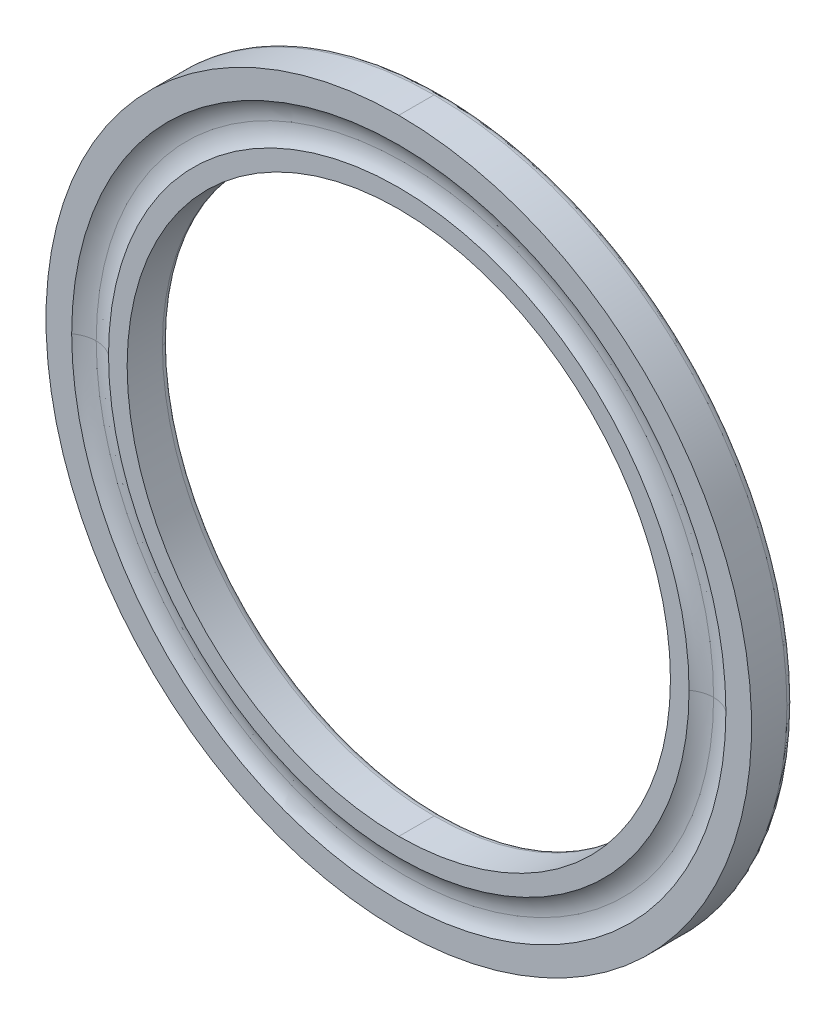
ISO-10303-21;
HEADER;
FILE_DESCRIPTION(('STEP AP214'),'2;1');
FILE_NAME('part.step','',(''),(''),'','','');
FILE_SCHEMA(('AUTOMOTIVE_DESIGN { 1 0 10303 214 1 1 1 1 }'));
ENDSEC;
DATA;
#1=APPLICATION_CONTEXT('core data for automotive mechanical design processes');
#2=APPLICATION_PROTOCOL_DEFINITION('international standard','automotive_design',2000,#1);
#3=PRODUCT_CONTEXT('',#1,'mechanical');
#4=PRODUCT('Part','Part','',(#3));
#5=PRODUCT_RELATED_PRODUCT_CATEGORY('part','',(#4));
#6=PRODUCT_DEFINITION_FORMATION('','',#4);
#7=PRODUCT_DEFINITION_CONTEXT('part definition',#1,'design');
#8=PRODUCT_DEFINITION('design','',#6,#7);
#9=PRODUCT_DEFINITION_SHAPE('','',#8);
#10=(LENGTH_UNIT() NAMED_UNIT(*) SI_UNIT(.MILLI.,.METRE.));
#11=(NAMED_UNIT(*) PLANE_ANGLE_UNIT() SI_UNIT($,.RADIAN.));
#12=(NAMED_UNIT(*) SI_UNIT($,.STERADIAN.) SOLID_ANGLE_UNIT());
#13=UNCERTAINTY_MEASURE_WITH_UNIT(LENGTH_MEASURE(1.E-05),#10,'distance_accuracy_value','');
#14=(GEOMETRIC_REPRESENTATION_CONTEXT(3) GLOBAL_UNCERTAINTY_ASSIGNED_CONTEXT((#13)) GLOBAL_UNIT_ASSIGNED_CONTEXT((#10,
#11,#12)) REPRESENTATION_CONTEXT('',''));
#15=CARTESIAN_POINT('',(0.,0.,0.));
#16=DIRECTION('',(0.,0.,1.));
#17=DIRECTION('',(1.,0.,0.));
#18=AXIS2_PLACEMENT_3D('',#15,#16,#17);
#19=CARTESIAN_POINT('',(0.,0.,-18.));
#20=DIRECTION('',(0.,0.,1.));
#21=DIRECTION('',(1.,0.,0.));
#22=AXIS2_PLACEMENT_3D('',#19,#20,#21);
#23=TOROIDAL_SURFACE('',#22,39.5,0.999999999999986);
#24=CARTESIAN_POINT('',(39.5,0.,-18.));
#25=DIRECTION('',(0.,-1.,0.));
#26=DIRECTION('',(-0.707106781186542,0.,-0.707106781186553));
#27=AXIS2_PLACEMENT_3D('',#24,#25,#26);
#28=CIRCLE('',#27,0.999999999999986);
#29=CARTESIAN_POINT('',(38.7928932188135,0.,-18.7071067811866));
#30=VERTEX_POINT('',#29);
#31=CARTESIAN_POINT('',(39.5,0.,-19.));
#32=VERTEX_POINT('',#31);
#33=EDGE_CURVE('E24',#30,#32,#28,.T.);
#34=ORIENTED_EDGE('',*,*,#33,.F.);
#35=CARTESIAN_POINT('',(0.,0.,-18.7071067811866));
#36=DIRECTION('',(0.,0.,1.));
#37=DIRECTION('',(1.,0.,0.));
#38=AXIS2_PLACEMENT_3D('',#35,#36,#37);
#39=CIRCLE('',#38,38.7928932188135);
#40=CARTESIAN_POINT('',(-38.7928932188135,0.,-18.7071067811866));
#41=VERTEX_POINT('',#40);
#42=EDGE_CURVE('E19',#30,#41,#39,.T.);
#43=ORIENTED_EDGE('',*,*,#42,.T.);
#44=CARTESIAN_POINT('',(-39.5,0.,-18.));
#45=DIRECTION('',(0.,1.,0.));
#46=DIRECTION('',(0.707106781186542,0.,-0.707106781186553));
#47=AXIS2_PLACEMENT_3D('',#44,#45,#46);
#48=CIRCLE('',#47,0.999999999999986);
#49=CARTESIAN_POINT('',(-39.5,0.,-19.));
#50=VERTEX_POINT('',#49);
#51=EDGE_CURVE('E10',#41,#50,#48,.T.);
#52=ORIENTED_EDGE('',*,*,#51,.T.);
#53=CARTESIAN_POINT('',(0.,0.,-19.));
#54=DIRECTION('',(0.,0.,1.));
#55=DIRECTION('',(0.,1.,0.));
#56=AXIS2_PLACEMENT_3D('',#53,#54,#55);
#57=CIRCLE('',#56,39.5);
#58=CARTESIAN_POINT('',(0.,39.5,-19.));
#59=VERTEX_POINT('',#58);
#60=EDGE_CURVE('E38',#59,#50,#57,.T.);
#61=ORIENTED_EDGE('',*,*,#60,.F.);
#62=CARTESIAN_POINT('',(0.,0.,-19.));
#63=DIRECTION('',(0.,0.,1.));
#64=DIRECTION('',(1.,0.,0.));
#65=AXIS2_PLACEMENT_3D('',#62,#63,#64);
#66=CIRCLE('',#65,39.5);
#67=EDGE_CURVE('E266',#32,#59,#66,.T.);
#68=ORIENTED_EDGE('',*,*,#67,.F.);
#69=EDGE_LOOP('',(#34,#43,#52,#61,#68));
#70=FACE_BOUND('',#69,.T.);
#71=ADVANCED_FACE('F16',(#70),#23,.T.);
#72=CARTESIAN_POINT('',(0.,0.,-18.));
#73=DIRECTION('',(0.,0.,1.));
#74=DIRECTION('',(1.,0.,0.));
#75=AXIS2_PLACEMENT_3D('',#72,#73,#74);
#76=TOROIDAL_SURFACE('',#75,39.5,0.999999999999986);
#77=CARTESIAN_POINT('',(0.,0.,-19.));
#78=DIRECTION('',(0.,0.,1.));
#79=DIRECTION('',(-1.,0.,0.));
#80=AXIS2_PLACEMENT_3D('',#77,#78,#79);
#81=CIRCLE('',#80,39.5);
#82=CARTESIAN_POINT('',(0.,-39.5,-19.));
#83=VERTEX_POINT('',#82);
#84=EDGE_CURVE('E170',#50,#83,#81,.T.);
#85=ORIENTED_EDGE('',*,*,#84,.F.);
#86=ORIENTED_EDGE('',*,*,#51,.F.);
#87=CARTESIAN_POINT('',(0.,0.,-18.7071067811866));
#88=DIRECTION('',(0.,0.,1.));
#89=DIRECTION('',(-1.,0.,0.));
#90=AXIS2_PLACEMENT_3D('',#87,#88,#89);
#91=CIRCLE('',#90,38.7928932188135);
#92=EDGE_CURVE('E246',#41,#30,#91,.T.);
#93=ORIENTED_EDGE('',*,*,#92,.T.);
#94=ORIENTED_EDGE('',*,*,#33,.T.);
#95=CARTESIAN_POINT('',(0.,0.,-19.));
#96=DIRECTION('',(0.,0.,1.));
#97=DIRECTION('',(0.,-1.,0.));
#98=AXIS2_PLACEMENT_3D('',#95,#96,#97);
#99=CIRCLE('',#98,39.5);
#100=EDGE_CURVE('E31',#83,#32,#99,.T.);
#101=ORIENTED_EDGE('',*,*,#100,.F.);
#102=EDGE_LOOP('',(#85,#86,#93,#94,#101));
#103=FACE_BOUND('',#102,.T.);
#104=ADVANCED_FACE('F257',(#103),#76,.T.);
#105=CARTESIAN_POINT('',(0.,0.,-18.));
#106=DIRECTION('',(0.,0.,1.));
#107=DIRECTION('',(1.,0.,0.));
#108=AXIS2_PLACEMENT_3D('',#105,#106,#107);
#109=TOROIDAL_SURFACE('',#108,39.5,0.999999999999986);
#110=CARTESIAN_POINT('',(0.,0.,-18.));
#111=DIRECTION('',(0.,0.,1.));
#112=DIRECTION('',(0.,-1.,0.));
#113=AXIS2_PLACEMENT_3D('',#110,#111,#112);
#114=CIRCLE('',#113,38.5);
#115=CARTESIAN_POINT('',(0.,-38.5,-18.));
#116=VERTEX_POINT('',#115);
#117=CARTESIAN_POINT('',(38.5,0.,-18.));
#118=VERTEX_POINT('',#117);
#119=EDGE_CURVE('E237',#116,#118,#114,.T.);
#120=ORIENTED_EDGE('',*,*,#119,.T.);
#121=CARTESIAN_POINT('',(39.5,0.,-18.));
#122=DIRECTION('',(0.,-1.,0.));
#123=DIRECTION('',(-1.,0.,0.));
#124=AXIS2_PLACEMENT_3D('',#121,#122,#123);
#125=CIRCLE('',#124,0.999999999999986);
#126=EDGE_CURVE('E241',#118,#30,#125,.T.);
#127=ORIENTED_EDGE('',*,*,#126,.T.);
#128=ORIENTED_EDGE('',*,*,#92,.F.);
#129=CARTESIAN_POINT('',(-39.5,0.,-18.));
#130=DIRECTION('',(0.,1.,0.));
#131=DIRECTION('',(1.,0.,0.));
#132=AXIS2_PLACEMENT_3D('',#129,#130,#131);
#133=CIRCLE('',#132,0.999999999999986);
#134=CARTESIAN_POINT('',(-38.5,0.,-18.));
#135=VERTEX_POINT('',#134);
#136=EDGE_CURVE('E247',#135,#41,#133,.T.);
#137=ORIENTED_EDGE('',*,*,#136,.F.);
#138=CARTESIAN_POINT('',(0.,0.,-18.));
#139=DIRECTION('',(0.,0.,1.));
#140=DIRECTION('',(-1.,0.,0.));
#141=AXIS2_PLACEMENT_3D('',#138,#139,#140);
#142=CIRCLE('',#141,38.5);
#143=EDGE_CURVE('E244',#135,#116,#142,.T.);
#144=ORIENTED_EDGE('',*,*,#143,.T.);
#145=EDGE_LOOP('',(#120,#127,#128,#137,#144));
#146=FACE_BOUND('',#145,.T.);
#147=ADVANCED_FACE('F261',(#146),#109,.T.);
#148=CARTESIAN_POINT('',(0.,0.,-15.5));
#149=DIRECTION('',(0.,0.,1.));
#150=DIRECTION('',(0.,1.,0.));
#151=AXIS2_PLACEMENT_3D('',#148,#149,#150);
#152=CYLINDRICAL_SURFACE('',#151,38.5);
#153=CARTESIAN_POINT('',(0.,0.,-18.));
#154=DIRECTION('',(0.,0.,1.));
#155=DIRECTION('',(0.,1.,0.));
#156=AXIS2_PLACEMENT_3D('',#153,#154,#155);
#157=CIRCLE('',#156,38.5);
#158=CARTESIAN_POINT('',(0.,38.5,-18.));
#159=VERTEX_POINT('',#158);
#160=EDGE_CURVE('E238',#159,#135,#157,.T.);
#161=ORIENTED_EDGE('',*,*,#160,.F.);
#162=DIRECTION('',(0.,0.,1.));
#163=VECTOR('',#162,1.);
#164=CARTESIAN_POINT('',(0.,38.5,-18.));
#165=LINE('',#164,#163);
#166=CARTESIAN_POINT('',(0.,38.5,-13.));
#167=VERTEX_POINT('',#166);
#168=EDGE_CURVE('E232',#159,#167,#165,.T.);
#169=ORIENTED_EDGE('',*,*,#168,.T.);
#170=CARTESIAN_POINT('',(0.,0.,-13.));
#171=DIRECTION('',(0.,0.,-1.));
#172=DIRECTION('',(0.,-1.,0.));
#173=AXIS2_PLACEMENT_3D('',#170,#171,#172);
#174=CIRCLE('',#173,38.5);
#175=CARTESIAN_POINT('',(0.,-38.5,-13.));
#176=VERTEX_POINT('',#175);
#177=EDGE_CURVE('E228',#176,#167,#174,.T.);
#178=ORIENTED_EDGE('',*,*,#177,.F.);
#179=DIRECTION('',(0.,0.,1.));
#180=VECTOR('',#179,1.);
#181=CARTESIAN_POINT('',(0.,-38.5,-18.));
#182=LINE('',#181,#180);
#183=EDGE_CURVE('E234',#116,#176,#182,.T.);
#184=ORIENTED_EDGE('',*,*,#183,.F.);
#185=ORIENTED_EDGE('',*,*,#143,.F.);
#186=EDGE_LOOP('',(#161,#169,#178,#184,#185));
#187=FACE_BOUND('',#186,.T.);
#188=ADVANCED_FACE('F288',(#187),#152,.F.);
#189=CARTESIAN_POINT('',(0.,0.,-18.));
#190=DIRECTION('',(0.,0.,1.));
#191=DIRECTION('',(1.,0.,0.));
#192=AXIS2_PLACEMENT_3D('',#189,#190,#191);
#193=TOROIDAL_SURFACE('',#192,39.5,0.999999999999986);
#194=ORIENTED_EDGE('',*,*,#136,.T.);
#195=ORIENTED_EDGE('',*,*,#42,.F.);
#196=ORIENTED_EDGE('',*,*,#126,.F.);
#197=CARTESIAN_POINT('',(0.,0.,-18.));
#198=DIRECTION('',(0.,0.,1.));
#199=DIRECTION('',(1.,0.,0.));
#200=AXIS2_PLACEMENT_3D('',#197,#198,#199);
#201=CIRCLE('',#200,38.5);
#202=EDGE_CURVE('E231',#118,#159,#201,.T.);
#203=ORIENTED_EDGE('',*,*,#202,.T.);
#204=ORIENTED_EDGE('',*,*,#160,.T.);
#205=EDGE_LOOP('',(#194,#195,#196,#203,#204));
#206=FACE_BOUND('',#205,.T.);
#207=ADVANCED_FACE('F265',(#206),#193,.T.);
#208=CARTESIAN_POINT('',(0.,0.,-15.5));
#209=DIRECTION('',(0.,0.,1.));
#210=DIRECTION('',(0.,1.,0.));
#211=AXIS2_PLACEMENT_3D('',#208,#209,#210);
#212=CYLINDRICAL_SURFACE('',#211,38.5);
#213=ORIENTED_EDGE('',*,*,#119,.F.);
#214=ORIENTED_EDGE('',*,*,#183,.T.);
#215=CARTESIAN_POINT('',(0.,0.,-13.));
#216=DIRECTION('',(0.,0.,-1.));
#217=DIRECTION('',(0.,1.,0.));
#218=AXIS2_PLACEMENT_3D('',#215,#216,#217);
#219=CIRCLE('',#218,38.5);
#220=EDGE_CURVE('E222',#167,#176,#219,.T.);
#221=ORIENTED_EDGE('',*,*,#220,.F.);
#222=ORIENTED_EDGE('',*,*,#168,.F.);
#223=ORIENTED_EDGE('',*,*,#202,.F.);
#224=EDGE_LOOP('',(#213,#214,#221,#222,#223));
#225=FACE_BOUND('',#224,.T.);
#226=ADVANCED_FACE('F296',(#225),#212,.F.);
#227=CARTESIAN_POINT('',(0.,0.,-9.50050000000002));
#228=DIRECTION('',(0.,0.,1.));
#229=DIRECTION('',(1.,0.,0.));
#230=AXIS2_PLACEMENT_3D('',#227,#228,#229);
#231=TOROIDAL_SURFACE('',#230,43.75,4.36549999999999);
#232=CARTESIAN_POINT('',(43.75,0.,-9.50050000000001));
#233=DIRECTION('',(0.,-1.,0.));
#234=DIRECTION('',(-0.597825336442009,0.,-0.801626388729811));
#235=AXIS2_PLACEMENT_3D('',#232,#233,#234);
#236=CIRCLE('',#235,4.36549999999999);
#237=CARTESIAN_POINT('',(41.1401934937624,0.,-13.));
#238=VERTEX_POINT('',#237);
#239=CARTESIAN_POINT('',(43.75,0.,-13.866));
#240=VERTEX_POINT('',#239);
#241=EDGE_CURVE('E210',#238,#240,#236,.T.);
#242=ORIENTED_EDGE('',*,*,#241,.T.);
#243=CARTESIAN_POINT('',(0.,0.,-13.866));
#244=DIRECTION('',(0.,0.,1.));
#245=DIRECTION('',(1.,0.,0.));
#246=AXIS2_PLACEMENT_3D('',#243,#244,#245);
#247=CIRCLE('',#246,43.75);
#248=CARTESIAN_POINT('',(-43.75,0.,-13.866));
#249=VERTEX_POINT('',#248);
#250=EDGE_CURVE('E200',#240,#249,#247,.T.);
#251=ORIENTED_EDGE('',*,*,#250,.T.);
#252=CARTESIAN_POINT('',(-43.75,0.,-9.50050000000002));
#253=DIRECTION('',(0.,1.,0.));
#254=DIRECTION('',(0.597825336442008,0.,-0.801626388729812));
#255=AXIS2_PLACEMENT_3D('',#252,#253,#254);
#256=CIRCLE('',#255,4.36549999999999);
#257=CARTESIAN_POINT('',(-41.1401934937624,0.,-13.));
#258=VERTEX_POINT('',#257);
#259=EDGE_CURVE('E212',#258,#249,#256,.T.);
#260=ORIENTED_EDGE('',*,*,#259,.F.);
#261=CARTESIAN_POINT('',(0.,0.,-13.));
#262=DIRECTION('',(0.,0.,1.));
#263=DIRECTION('',(0.,1.,0.));
#264=AXIS2_PLACEMENT_3D('',#261,#262,#263);
#265=CIRCLE('',#264,41.1401934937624);
#266=CARTESIAN_POINT('',(0.,41.1401934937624,-13.));
#267=VERTEX_POINT('',#266);
#268=EDGE_CURVE('E216',#267,#258,#265,.T.);
#269=ORIENTED_EDGE('',*,*,#268,.F.);
#270=CARTESIAN_POINT('',(0.,0.,-13.));
#271=DIRECTION('',(0.,0.,1.));
#272=DIRECTION('',(1.,0.,0.));
#273=AXIS2_PLACEMENT_3D('',#270,#271,#272);
#274=CIRCLE('',#273,41.1401934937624);
#275=EDGE_CURVE('E219',#238,#267,#274,.T.);
#276=ORIENTED_EDGE('',*,*,#275,.F.);
#277=EDGE_LOOP('',(#242,#251,#260,#269,#276));
#278=FACE_BOUND('',#277,.T.);
#279=ADVANCED_FACE('F299',(#278),#231,.F.);
#280=CARTESIAN_POINT('',(0.,39.8200967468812,-13.));
#281=DIRECTION('',(0.,0.,1.));
#282=DIRECTION('',(1.,0.,0.));
#283=AXIS2_PLACEMENT_3D('',#280,#281,#282);
#284=PLANE('',#283);
#285=ORIENTED_EDGE('',*,*,#177,.T.);
#286=ORIENTED_EDGE('',*,*,#220,.T.);
#287=EDGE_LOOP('',(#285,#286));
#288=FACE_BOUND('',#287,.T.);
#289=CARTESIAN_POINT('',(0.,0.,-13.));
#290=DIRECTION('',(0.,0.,1.));
#291=DIRECTION('',(-1.,0.,0.));
#292=AXIS2_PLACEMENT_3D('',#289,#290,#291);
#293=CIRCLE('',#292,41.1401934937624);
#294=CARTESIAN_POINT('',(0.,-41.1401934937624,-13.));
#295=VERTEX_POINT('',#294);
#296=EDGE_CURVE('E215',#258,#295,#293,.T.);
#297=ORIENTED_EDGE('',*,*,#296,.T.);
#298=CARTESIAN_POINT('',(0.,0.,-13.));
#299=DIRECTION('',(0.,0.,1.));
#300=DIRECTION('',(0.,-1.,0.));
#301=AXIS2_PLACEMENT_3D('',#298,#299,#300);
#302=CIRCLE('',#301,41.1401934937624);
#303=EDGE_CURVE('E207',#295,#238,#302,.T.);
#304=ORIENTED_EDGE('',*,*,#303,.T.);
#305=ORIENTED_EDGE('',*,*,#275,.T.);
#306=ORIENTED_EDGE('',*,*,#268,.T.);
#307=EDGE_LOOP('',(#297,#304,#305,#306));
#308=FACE_BOUND('',#307,.T.);
#309=ADVANCED_FACE('F303',(#288,#308),#284,.T.);
#310=CARTESIAN_POINT('',(0.,0.,-9.50050000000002));
#311=DIRECTION('',(0.,0.,1.));
#312=DIRECTION('',(1.,0.,0.));
#313=AXIS2_PLACEMENT_3D('',#310,#311,#312);
#314=TOROIDAL_SURFACE('',#313,43.75,4.36549999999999);
#315=ORIENTED_EDGE('',*,*,#296,.F.);
#316=ORIENTED_EDGE('',*,*,#259,.T.);
#317=CARTESIAN_POINT('',(0.,0.,-13.866));
#318=DIRECTION('',(0.,0.,1.));
#319=DIRECTION('',(-1.,0.,0.));
#320=AXIS2_PLACEMENT_3D('',#317,#318,#319);
#321=CIRCLE('',#320,43.75);
#322=EDGE_CURVE('E204',#249,#240,#321,.T.);
#323=ORIENTED_EDGE('',*,*,#322,.T.);
#324=ORIENTED_EDGE('',*,*,#241,.F.);
#325=ORIENTED_EDGE('',*,*,#303,.F.);
#326=EDGE_LOOP('',(#315,#316,#323,#324,#325));
#327=FACE_BOUND('',#326,.T.);
#328=ADVANCED_FACE('F307',(#327),#314,.F.);
#329=CARTESIAN_POINT('',(0.,0.,-9.50050000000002));
#330=DIRECTION('',(0.,0.,1.));
#331=DIRECTION('',(1.,0.,0.));
#332=AXIS2_PLACEMENT_3D('',#329,#330,#331);
#333=TOROIDAL_SURFACE('',#332,43.75,4.36549999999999);
#334=CARTESIAN_POINT('',(43.75,0.,-9.50050000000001));
#335=DIRECTION('',(0.,-1.,0.));
#336=DIRECTION('',(0.,0.,-1.));
#337=AXIS2_PLACEMENT_3D('',#334,#335,#336);
#338=CIRCLE('',#337,4.36549999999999);
#339=CARTESIAN_POINT('',(46.3598065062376,0.,-13.));
#340=VERTEX_POINT('',#339);
#341=EDGE_CURVE('E198',#240,#340,#338,.T.);
#342=ORIENTED_EDGE('',*,*,#341,.F.);
#343=ORIENTED_EDGE('',*,*,#322,.F.);
#344=CARTESIAN_POINT('',(-43.75,0.,-9.50050000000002));
#345=DIRECTION('',(0.,1.,0.));
#346=DIRECTION('',(0.,0.,-1.));
#347=AXIS2_PLACEMENT_3D('',#344,#345,#346);
#348=CIRCLE('',#347,4.36549999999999);
#349=CARTESIAN_POINT('',(-46.3598065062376,0.,-13.));
#350=VERTEX_POINT('',#349);
#351=EDGE_CURVE('E202',#249,#350,#348,.T.);
#352=ORIENTED_EDGE('',*,*,#351,.T.);
#353=CARTESIAN_POINT('',(0.,0.,-13.));
#354=DIRECTION('',(0.,0.,-1.));
#355=DIRECTION('',(1.,0.,0.));
#356=AXIS2_PLACEMENT_3D('',#353,#354,#355);
#357=CIRCLE('',#356,46.3598065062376);
#358=EDGE_CURVE('E193',#340,#350,#357,.T.);
#359=ORIENTED_EDGE('',*,*,#358,.F.);
#360=EDGE_LOOP('',(#342,#343,#352,#359));
#361=FACE_BOUND('',#360,.T.);
#362=ADVANCED_FACE('F311',(#361),#333,.F.);
#363=CARTESIAN_POINT('',(0.,0.,-9.50050000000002));
#364=DIRECTION('',(0.,0.,1.));
#365=DIRECTION('',(1.,0.,0.));
#366=AXIS2_PLACEMENT_3D('',#363,#364,#365);
#367=TOROIDAL_SURFACE('',#366,43.75,4.36549999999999);
#368=ORIENTED_EDGE('',*,*,#351,.F.);
#369=ORIENTED_EDGE('',*,*,#250,.F.);
#370=ORIENTED_EDGE('',*,*,#341,.T.);
#371=CARTESIAN_POINT('',(0.,0.,-13.));
#372=DIRECTION('',(0.,0.,-1.));
#373=DIRECTION('',(0.,1.,0.));
#374=AXIS2_PLACEMENT_3D('',#371,#372,#373);
#375=CIRCLE('',#374,46.3598065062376);
#376=CARTESIAN_POINT('',(0.,46.3598065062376,-13.));
#377=VERTEX_POINT('',#376);
#378=EDGE_CURVE('E185',#377,#340,#375,.T.);
#379=ORIENTED_EDGE('',*,*,#378,.F.);
#380=CARTESIAN_POINT('',(0.,0.,-13.));
#381=DIRECTION('',(0.,0.,-1.));
#382=DIRECTION('',(-1.,0.,0.));
#383=AXIS2_PLACEMENT_3D('',#380,#381,#382);
#384=CIRCLE('',#383,46.3598065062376);
#385=EDGE_CURVE('E190',#350,#377,#384,.T.);
#386=ORIENTED_EDGE('',*,*,#385,.F.);
#387=EDGE_LOOP('',(#368,#369,#370,#379,#386));
#388=FACE_BOUND('',#387,.T.);
#389=ADVANCED_FACE('F315',(#388),#367,.F.);
#390=CARTESIAN_POINT('',(0.,0.,-18.));
#391=DIRECTION('',(0.,0.,1.));
#392=DIRECTION('',(1.,0.,0.));
#393=AXIS2_PLACEMENT_3D('',#390,#391,#392);
#394=TOROIDAL_SURFACE('',#393,49.,0.999999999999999);
#395=CARTESIAN_POINT('',(49.,0.,-18.));
#396=DIRECTION('',(0.,-1.,0.));
#397=DIRECTION('',(0.707106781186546,0.,-0.707106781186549));
#398=AXIS2_PLACEMENT_3D('',#395,#396,#397);
#399=CIRCLE('',#398,0.999999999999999);
#400=CARTESIAN_POINT('',(49.7071067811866,0.,-18.7071067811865));
#401=VERTEX_POINT('',#400);
#402=CARTESIAN_POINT('',(50.,0.,-18.));
#403=VERTEX_POINT('',#402);
#404=EDGE_CURVE('E163',#401,#403,#399,.T.);
#405=ORIENTED_EDGE('',*,*,#404,.F.);
#406=CARTESIAN_POINT('',(0.,0.,-18.7071067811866));
#407=DIRECTION('',(0.,0.,1.));
#408=DIRECTION('',(1.,0.,0.));
#409=AXIS2_PLACEMENT_3D('',#406,#407,#408);
#410=CIRCLE('',#409,49.7071067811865);
#411=CARTESIAN_POINT('',(-49.7071067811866,0.,-18.7071067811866));
#412=VERTEX_POINT('',#411);
#413=EDGE_CURVE('E153',#401,#412,#410,.T.);
#414=ORIENTED_EDGE('',*,*,#413,.T.);
#415=CARTESIAN_POINT('',(-49.,0.,-18.));
#416=DIRECTION('',(0.,1.,0.));
#417=DIRECTION('',(-0.707106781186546,0.,-0.707106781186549));
#418=AXIS2_PLACEMENT_3D('',#415,#416,#417);
#419=CIRCLE('',#418,0.999999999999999);
#420=CARTESIAN_POINT('',(-50.,0.,-18.));
#421=VERTEX_POINT('',#420);
#422=EDGE_CURVE('E167',#412,#421,#419,.T.);
#423=ORIENTED_EDGE('',*,*,#422,.T.);
#424=CARTESIAN_POINT('',(0.,0.,-18.));
#425=DIRECTION('',(0.,0.,-1.));
#426=DIRECTION('',(-1.,0.,0.));
#427=AXIS2_PLACEMENT_3D('',#424,#425,#426);
#428=CIRCLE('',#427,50.);
#429=CARTESIAN_POINT('',(0.,50.,-18.));
#430=VERTEX_POINT('',#429);
#431=EDGE_CURVE('E196',#421,#430,#428,.T.);
#432=ORIENTED_EDGE('',*,*,#431,.T.);
#433=CARTESIAN_POINT('',(0.,0.,-18.));
#434=DIRECTION('',(0.,0.,-1.));
#435=DIRECTION('',(0.,1.,0.));
#436=AXIS2_PLACEMENT_3D('',#433,#434,#435);
#437=CIRCLE('',#436,50.);
#438=EDGE_CURVE('E179',#430,#403,#437,.T.);
#439=ORIENTED_EDGE('',*,*,#438,.T.);
#440=EDGE_LOOP('',(#405,#414,#423,#432,#439));
#441=FACE_BOUND('',#440,.T.);
#442=ADVANCED_FACE('F319',(#441),#394,.T.);
#443=CARTESIAN_POINT('',(0.,0.,-15.5));
#444=DIRECTION('',(0.,0.,1.));
#445=DIRECTION('',(0.,1.,0.));
#446=AXIS2_PLACEMENT_3D('',#443,#444,#445);
#447=CYLINDRICAL_SURFACE('',#446,50.);
#448=DIRECTION('',(0.,0.,1.));
#449=VECTOR('',#448,1.);
#450=CARTESIAN_POINT('',(0.,50.,-18.));
#451=LINE('',#450,#449);
#452=CARTESIAN_POINT('',(0.,50.,-13.));
#453=VERTEX_POINT('',#452);
#454=EDGE_CURVE('E176',#430,#453,#451,.T.);
#455=ORIENTED_EDGE('',*,*,#454,.F.);
#456=ORIENTED_EDGE('',*,*,#431,.F.);
#457=CARTESIAN_POINT('',(0.,0.,-18.));
#458=DIRECTION('',(0.,0.,-1.));
#459=DIRECTION('',(0.,-1.,0.));
#460=AXIS2_PLACEMENT_3D('',#457,#458,#459);
#461=CIRCLE('',#460,50.);
#462=CARTESIAN_POINT('',(0.,-50.,-18.));
#463=VERTEX_POINT('',#462);
#464=EDGE_CURVE('E172',#463,#421,#461,.T.);
#465=ORIENTED_EDGE('',*,*,#464,.F.);
#466=DIRECTION('',(0.,0.,1.));
#467=VECTOR('',#466,1.);
#468=CARTESIAN_POINT('',(0.,-50.,-18.));
#469=LINE('',#468,#467);
#470=CARTESIAN_POINT('',(0.,-50.,-13.));
#471=VERTEX_POINT('',#470);
#472=EDGE_CURVE('E180',#463,#471,#469,.T.);
#473=ORIENTED_EDGE('',*,*,#472,.T.);
#474=CARTESIAN_POINT('',(0.,0.,-13.));
#475=DIRECTION('',(0.,0.,1.));
#476=DIRECTION('',(0.,1.,0.));
#477=AXIS2_PLACEMENT_3D('',#474,#475,#476);
#478=CIRCLE('',#477,50.);
#479=EDGE_CURVE('E182',#453,#471,#478,.T.);
#480=ORIENTED_EDGE('',*,*,#479,.F.);
#481=EDGE_LOOP('',(#455,#456,#465,#473,#480));
#482=FACE_BOUND('',#481,.T.);
#483=ADVANCED_FACE('F323',(#482),#447,.T.);
#484=CARTESIAN_POINT('',(0.,48.1799032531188,-13.));
#485=DIRECTION('',(0.,0.,1.));
#486=DIRECTION('',(1.,0.,0.));
#487=AXIS2_PLACEMENT_3D('',#484,#485,#486);
#488=PLANE('',#487);
#489=ORIENTED_EDGE('',*,*,#358,.T.);
#490=ORIENTED_EDGE('',*,*,#385,.T.);
#491=ORIENTED_EDGE('',*,*,#378,.T.);
#492=EDGE_LOOP('',(#489,#490,#491));
#493=FACE_BOUND('',#492,.T.);
#494=CARTESIAN_POINT('',(0.,0.,-13.));
#495=DIRECTION('',(0.,0.,1.));
#496=DIRECTION('',(0.,-1.,0.));
#497=AXIS2_PLACEMENT_3D('',#494,#495,#496);
#498=CIRCLE('',#497,50.);
#499=EDGE_CURVE('E175',#471,#453,#498,.T.);
#500=ORIENTED_EDGE('',*,*,#499,.T.);
#501=ORIENTED_EDGE('',*,*,#479,.T.);
#502=EDGE_LOOP('',(#500,#501));
#503=FACE_BOUND('',#502,.T.);
#504=ADVANCED_FACE('F327',(#493,#503),#488,.T.);
#505=CARTESIAN_POINT('',(0.,0.,-15.5));
#506=DIRECTION('',(0.,0.,1.));
#507=DIRECTION('',(0.,1.,0.));
#508=AXIS2_PLACEMENT_3D('',#505,#506,#507);
#509=CYLINDRICAL_SURFACE('',#508,50.);
#510=ORIENTED_EDGE('',*,*,#472,.F.);
#511=CARTESIAN_POINT('',(0.,0.,-18.));
#512=DIRECTION('',(0.,0.,-1.));
#513=DIRECTION('',(1.,0.,0.));
#514=AXIS2_PLACEMENT_3D('',#511,#512,#513);
#515=CIRCLE('',#514,50.);
#516=EDGE_CURVE('E160',#403,#463,#515,.T.);
#517=ORIENTED_EDGE('',*,*,#516,.F.);
#518=ORIENTED_EDGE('',*,*,#438,.F.);
#519=ORIENTED_EDGE('',*,*,#454,.T.);
#520=ORIENTED_EDGE('',*,*,#499,.F.);
#521=EDGE_LOOP('',(#510,#517,#518,#519,#520));
#522=FACE_BOUND('',#521,.T.);
#523=ADVANCED_FACE('F331',(#522),#509,.T.);
#524=CARTESIAN_POINT('',(0.,0.,-18.));
#525=DIRECTION('',(0.,0.,1.));
#526=DIRECTION('',(1.,0.,0.));
#527=AXIS2_PLACEMENT_3D('',#524,#525,#526);
#528=TOROIDAL_SURFACE('',#527,49.,0.999999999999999);
#529=ORIENTED_EDGE('',*,*,#464,.T.);
#530=ORIENTED_EDGE('',*,*,#422,.F.);
#531=CARTESIAN_POINT('',(0.,0.,-18.7071067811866));
#532=DIRECTION('',(0.,0.,1.));
#533=DIRECTION('',(-1.,0.,0.));
#534=AXIS2_PLACEMENT_3D('',#531,#532,#533);
#535=CIRCLE('',#534,49.7071067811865);
#536=EDGE_CURVE('E164',#412,#401,#535,.T.);
#537=ORIENTED_EDGE('',*,*,#536,.T.);
#538=ORIENTED_EDGE('',*,*,#404,.T.);
#539=ORIENTED_EDGE('',*,*,#516,.T.);
#540=EDGE_LOOP('',(#529,#530,#537,#538,#539));
#541=FACE_BOUND('',#540,.T.);
#542=ADVANCED_FACE('F279',(#541),#528,.T.);
#543=CARTESIAN_POINT('',(0.,0.,-18.));
#544=DIRECTION('',(0.,0.,1.));
#545=DIRECTION('',(1.,0.,0.));
#546=AXIS2_PLACEMENT_3D('',#543,#544,#545);
#547=TOROIDAL_SURFACE('',#546,49.,0.999999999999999);
#548=CARTESIAN_POINT('',(0.,0.,-19.));
#549=DIRECTION('',(0.,0.,-1.));
#550=DIRECTION('',(1.,0.,0.));
#551=AXIS2_PLACEMENT_3D('',#548,#549,#550);
#552=CIRCLE('',#551,49.);
#553=CARTESIAN_POINT('',(49.,0.,-19.));
#554=VERTEX_POINT('',#553);
#555=CARTESIAN_POINT('',(0.,-49.,-19.));
#556=VERTEX_POINT('',#555);
#557=EDGE_CURVE('E133',#554,#556,#552,.T.);
#558=ORIENTED_EDGE('',*,*,#557,.F.);
#559=CARTESIAN_POINT('',(49.,0.,-18.));
#560=DIRECTION('',(0.,-1.,0.));
#561=DIRECTION('',(0.,0.,-1.));
#562=AXIS2_PLACEMENT_3D('',#559,#560,#561);
#563=CIRCLE('',#562,0.999999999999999);
#564=EDGE_CURVE('E138',#554,#401,#563,.T.);
#565=ORIENTED_EDGE('',*,*,#564,.T.);
#566=ORIENTED_EDGE('',*,*,#536,.F.);
#567=CARTESIAN_POINT('',(-49.,0.,-18.));
#568=DIRECTION('',(0.,1.,0.));
#569=DIRECTION('',(0.,0.,-1.));
#570=AXIS2_PLACEMENT_3D('',#567,#568,#569);
#571=CIRCLE('',#570,0.999999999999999);
#572=CARTESIAN_POINT('',(-49.,0.,-19.));
#573=VERTEX_POINT('',#572);
#574=EDGE_CURVE('E155',#573,#412,#571,.T.);
#575=ORIENTED_EDGE('',*,*,#574,.F.);
#576=CARTESIAN_POINT('',(0.,0.,-19.));
#577=DIRECTION('',(0.,0.,-1.));
#578=DIRECTION('',(0.,-1.,0.));
#579=AXIS2_PLACEMENT_3D('',#576,#577,#578);
#580=CIRCLE('',#579,49.);
#581=EDGE_CURVE('E141',#556,#573,#580,.T.);
#582=ORIENTED_EDGE('',*,*,#581,.F.);
#583=EDGE_LOOP('',(#558,#565,#566,#575,#582));
#584=FACE_BOUND('',#583,.T.);
#585=ADVANCED_FACE('F135',(#584),#547,.T.);
#586=CARTESIAN_POINT('',(0.,44.25,-19.));
#587=DIRECTION('',(0.,0.,-1.));
#588=DIRECTION('',(-1.,0.,0.));
#589=AXIS2_PLACEMENT_3D('',#586,#587,#588);
#590=PLANE('',#589);
#591=ORIENTED_EDGE('',*,*,#84,.T.);
#592=ORIENTED_EDGE('',*,*,#100,.T.);
#593=ORIENTED_EDGE('',*,*,#67,.T.);
#594=ORIENTED_EDGE('',*,*,#60,.T.);
#595=EDGE_LOOP('',(#591,#592,#593,#594));
#596=FACE_BOUND('',#595,.T.);
#597=ORIENTED_EDGE('',*,*,#557,.T.);
#598=ORIENTED_EDGE('',*,*,#581,.T.);
#599=CARTESIAN_POINT('',(0.,0.,-19.));
#600=DIRECTION('',(0.,0.,-1.));
#601=DIRECTION('',(-1.,0.,0.));
#602=AXIS2_PLACEMENT_3D('',#599,#600,#601);
#603=CIRCLE('',#602,49.);
#604=CARTESIAN_POINT('',(0.,49.,-19.));
#605=VERTEX_POINT('',#604);
#606=EDGE_CURVE('E148',#573,#605,#603,.T.);
#607=ORIENTED_EDGE('',*,*,#606,.T.);
#608=CARTESIAN_POINT('',(0.,0.,-19.));
#609=DIRECTION('',(0.,0.,-1.));
#610=DIRECTION('',(0.,1.,0.));
#611=AXIS2_PLACEMENT_3D('',#608,#609,#610);
#612=CIRCLE('',#611,49.);
#613=EDGE_CURVE('E145',#605,#554,#612,.T.);
#614=ORIENTED_EDGE('',*,*,#613,.T.);
#615=EDGE_LOOP('',(#597,#598,#607,#614));
#616=FACE_BOUND('',#615,.T.);
#617=ADVANCED_FACE('F146',(#596,#616),#590,.T.);
#618=CARTESIAN_POINT('',(0.,0.,-18.));
#619=DIRECTION('',(0.,0.,1.));
#620=DIRECTION('',(1.,0.,0.));
#621=AXIS2_PLACEMENT_3D('',#618,#619,#620);
#622=TOROIDAL_SURFACE('',#621,49.,0.999999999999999);
#623=ORIENTED_EDGE('',*,*,#574,.T.);
#624=ORIENTED_EDGE('',*,*,#413,.F.);
#625=ORIENTED_EDGE('',*,*,#564,.F.);
#626=ORIENTED_EDGE('',*,*,#613,.F.);
#627=ORIENTED_EDGE('',*,*,#606,.F.);
#628=EDGE_LOOP('',(#623,#624,#625,#626,#627));
#629=FACE_BOUND('',#628,.T.);
#630=ADVANCED_FACE('F152',(#629),#622,.T.);
#631=CLOSED_SHELL('',(#71,#104,#147,#188,#207,#226,#279,#309,#328,#362,#389,#442,#483,#504,#523,
#542,#585,#617,#630));
#632=MANIFOLD_SOLID_BREP('B1',#631);
#633=ADVANCED_BREP_SHAPE_REPRESENTATION('',(#18,#632),#14);
#634=SHAPE_DEFINITION_REPRESENTATION(#9,#633);
ENDSEC;
END-ISO-10303-21;
